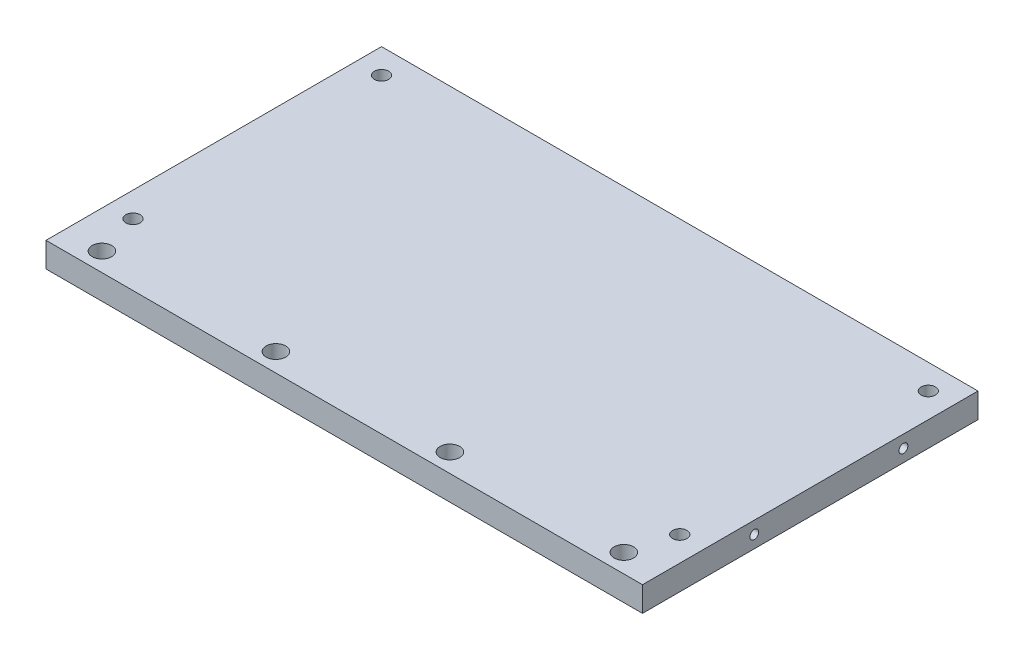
ISO-10303-21;
HEADER;
FILE_DESCRIPTION(('STEP AP214'),'2;1');
FILE_NAME('part.step','',(''),(''),'','','');
FILE_SCHEMA(('AUTOMOTIVE_DESIGN { 1 0 10303 214 1 1 1 1 }'));
ENDSEC;
DATA;
#1=APPLICATION_CONTEXT('core data for automotive mechanical design processes');
#2=APPLICATION_PROTOCOL_DEFINITION('international standard','automotive_design',2000,#1);
#3=PRODUCT_CONTEXT('',#1,'mechanical');
#4=PRODUCT('Part','Part','',(#3));
#5=PRODUCT_RELATED_PRODUCT_CATEGORY('part','',(#4));
#6=PRODUCT_DEFINITION_FORMATION('','',#4);
#7=PRODUCT_DEFINITION_CONTEXT('part definition',#1,'design');
#8=PRODUCT_DEFINITION('design','',#6,#7);
#9=PRODUCT_DEFINITION_SHAPE('','',#8);
#10=(LENGTH_UNIT() NAMED_UNIT(*) SI_UNIT(.MILLI.,.METRE.));
#11=(NAMED_UNIT(*) PLANE_ANGLE_UNIT() SI_UNIT($,.RADIAN.));
#12=(NAMED_UNIT(*) SI_UNIT($,.STERADIAN.) SOLID_ANGLE_UNIT());
#13=UNCERTAINTY_MEASURE_WITH_UNIT(LENGTH_MEASURE(1.E-05),#10,'distance_accuracy_value','');
#14=(GEOMETRIC_REPRESENTATION_CONTEXT(3) GLOBAL_UNCERTAINTY_ASSIGNED_CONTEXT((#13)) GLOBAL_UNIT_ASSIGNED_CONTEXT((#10,
#11,#12)) REPRESENTATION_CONTEXT('',''));
#15=CARTESIAN_POINT('',(0.,0.,0.));
#16=DIRECTION('',(0.,0.,1.));
#17=DIRECTION('',(1.,0.,0.));
#18=AXIS2_PLACEMENT_3D('',#15,#16,#17);
#19=CARTESIAN_POINT('',(0.,6.35,0.));
#20=DIRECTION('',(1.,0.,0.));
#21=DIRECTION('',(0.,0.,-1.));
#22=AXIS2_PLACEMENT_3D('',#19,#20,#21);
#23=PLANE('',#22);
#24=CARTESIAN_POINT('',(0.,3.175,-28.575));
#25=DIRECTION('',(-1.,0.,0.));
#26=DIRECTION('',(0.,0.,1.));
#27=AXIS2_PLACEMENT_3D('',#24,#25,#26);
#28=CIRCLE('',#27,1.1303);
#29=CARTESIAN_POINT('',(0.,3.175,-27.4447));
#30=VERTEX_POINT('',#29);
#31=EDGE_CURVE('E134',#30,#30,#28,.T.);
#32=ORIENTED_EDGE('',*,*,#31,.F.);
#33=EDGE_LOOP('',(#32));
#34=FACE_BOUND('',#33,.T.);
#35=CARTESIAN_POINT('',(0.,3.175,-66.675));
#36=DIRECTION('',(-1.,0.,0.));
#37=DIRECTION('',(0.,0.,1.));
#38=AXIS2_PLACEMENT_3D('',#35,#36,#37);
#39=CIRCLE('',#38,1.1303);
#40=CARTESIAN_POINT('',(0.,3.175,-65.5447));
#41=VERTEX_POINT('',#40);
#42=EDGE_CURVE('E137',#41,#41,#39,.T.);
#43=ORIENTED_EDGE('',*,*,#42,.F.);
#44=EDGE_LOOP('',(#43));
#45=FACE_BOUND('',#44,.T.);
#46=DIRECTION('',(0.,0.,1.));
#47=VECTOR('',#46,1.);
#48=CARTESIAN_POINT('',(0.,0.,0.));
#49=LINE('',#48,#47);
#50=CARTESIAN_POINT('',(0.,0.,-85.725));
#51=VERTEX_POINT('',#50);
#52=CARTESIAN_POINT('',(0.,0.,0.));
#53=VERTEX_POINT('',#52);
#54=EDGE_CURVE('E73',#51,#53,#49,.T.);
#55=ORIENTED_EDGE('',*,*,#54,.T.);
#56=DIRECTION('',(0.,-1.,0.));
#57=VECTOR('',#56,1.);
#58=CARTESIAN_POINT('',(0.,6.35,0.));
#59=LINE('',#58,#57);
#60=CARTESIAN_POINT('',(0.,6.35,0.));
#61=VERTEX_POINT('',#60);
#62=EDGE_CURVE('E11',#61,#53,#59,.T.);
#63=ORIENTED_EDGE('',*,*,#62,.F.);
#64=DIRECTION('',(0.,0.,1.));
#65=VECTOR('',#64,1.);
#66=CARTESIAN_POINT('',(0.,6.35,0.));
#67=LINE('',#66,#65);
#68=CARTESIAN_POINT('',(0.,6.35,-85.725));
#69=VERTEX_POINT('',#68);
#70=EDGE_CURVE('E96',#69,#61,#67,.T.);
#71=ORIENTED_EDGE('',*,*,#70,.F.);
#72=DIRECTION('',(0.,-1.,0.));
#73=VECTOR('',#72,1.);
#74=CARTESIAN_POINT('',(0.,6.35,-85.725));
#75=LINE('',#74,#73);
#76=EDGE_CURVE('E85',#69,#51,#75,.T.);
#77=ORIENTED_EDGE('',*,*,#76,.T.);
#78=EDGE_LOOP('',(#55,#63,#71,#77));
#79=FACE_BOUND('',#78,.T.);
#80=ADVANCED_FACE('F29',(#34,#45,#79),#23,.F.);
#81=CARTESIAN_POINT('',(0.,6.35,0.));
#82=DIRECTION('',(0.,0.,-1.));
#83=DIRECTION('',(-1.,0.,0.));
#84=AXIS2_PLACEMENT_3D('',#81,#82,#83);
#85=PLANE('',#84);
#86=DIRECTION('',(1.,0.,0.));
#87=VECTOR('',#86,1.);
#88=CARTESIAN_POINT('',(0.,0.,0.));
#89=LINE('',#88,#87);
#90=CARTESIAN_POINT('',(152.4,0.,0.));
#91=VERTEX_POINT('',#90);
#92=EDGE_CURVE('E69',#53,#91,#89,.T.);
#93=ORIENTED_EDGE('',*,*,#92,.T.);
#94=DIRECTION('',(0.,-1.,0.));
#95=VECTOR('',#94,1.);
#96=CARTESIAN_POINT('',(152.4,6.35,0.));
#97=LINE('',#96,#95);
#98=CARTESIAN_POINT('',(152.4,6.35,0.));
#99=VERTEX_POINT('',#98);
#100=EDGE_CURVE('E36',#99,#91,#97,.T.);
#101=ORIENTED_EDGE('',*,*,#100,.F.);
#102=DIRECTION('',(1.,0.,0.));
#103=VECTOR('',#102,1.);
#104=CARTESIAN_POINT('',(0.,6.35,0.));
#105=LINE('',#104,#103);
#106=EDGE_CURVE('E81',#61,#99,#105,.T.);
#107=ORIENTED_EDGE('',*,*,#106,.F.);
#108=ORIENTED_EDGE('',*,*,#62,.T.);
#109=EDGE_LOOP('',(#93,#101,#107,#108));
#110=FACE_BOUND('',#109,.T.);
#111=ADVANCED_FACE('F80',(#110),#85,.F.);
#112=CARTESIAN_POINT('',(152.4,6.35,0.));
#113=DIRECTION('',(-1.,0.,0.));
#114=DIRECTION('',(0.,0.,1.));
#115=AXIS2_PLACEMENT_3D('',#112,#113,#114);
#116=PLANE('',#115);
#117=CARTESIAN_POINT('',(152.4,3.175,-66.675));
#118=DIRECTION('',(1.,0.,0.));
#119=DIRECTION('',(0.,0.,-1.));
#120=AXIS2_PLACEMENT_3D('',#117,#118,#119);
#121=CIRCLE('',#120,1.1303);
#122=CARTESIAN_POINT('',(152.4,3.175,-67.8053));
#123=VERTEX_POINT('',#122);
#124=EDGE_CURVE('E172',#123,#123,#121,.T.);
#125=ORIENTED_EDGE('',*,*,#124,.F.);
#126=EDGE_LOOP('',(#125));
#127=FACE_BOUND('',#126,.T.);
#128=CARTESIAN_POINT('',(152.4,3.175,-28.575));
#129=DIRECTION('',(1.,0.,0.));
#130=DIRECTION('',(0.,0.,-1.));
#131=AXIS2_PLACEMENT_3D('',#128,#129,#130);
#132=CIRCLE('',#131,1.1303);
#133=CARTESIAN_POINT('',(152.4,3.175,-29.7053));
#134=VERTEX_POINT('',#133);
#135=EDGE_CURVE('E178',#134,#134,#132,.T.);
#136=ORIENTED_EDGE('',*,*,#135,.F.);
#137=EDGE_LOOP('',(#136));
#138=FACE_BOUND('',#137,.T.);
#139=DIRECTION('',(0.,0.,-1.));
#140=VECTOR('',#139,1.);
#141=CARTESIAN_POINT('',(152.4,0.,0.));
#142=LINE('',#141,#140);
#143=CARTESIAN_POINT('',(152.4,0.,-85.725));
#144=VERTEX_POINT('',#143);
#145=EDGE_CURVE('E74',#91,#144,#142,.T.);
#146=ORIENTED_EDGE('',*,*,#145,.T.);
#147=DIRECTION('',(0.,-1.,0.));
#148=VECTOR('',#147,1.);
#149=CARTESIAN_POINT('',(152.4,6.35,-85.725));
#150=LINE('',#149,#148);
#151=CARTESIAN_POINT('',(152.4,6.35,-85.725));
#152=VERTEX_POINT('',#151);
#153=EDGE_CURVE('E102',#152,#144,#150,.T.);
#154=ORIENTED_EDGE('',*,*,#153,.F.);
#155=DIRECTION('',(0.,0.,-1.));
#156=VECTOR('',#155,1.);
#157=CARTESIAN_POINT('',(152.4,6.35,0.));
#158=LINE('',#157,#156);
#159=EDGE_CURVE('E48',#99,#152,#158,.T.);
#160=ORIENTED_EDGE('',*,*,#159,.F.);
#161=ORIENTED_EDGE('',*,*,#100,.T.);
#162=EDGE_LOOP('',(#146,#154,#160,#161));
#163=FACE_BOUND('',#162,.T.);
#164=ADVANCED_FACE('F105',(#127,#138,#163),#116,.F.);
#165=CARTESIAN_POINT('',(0.,6.35,-85.725));
#166=DIRECTION('',(0.,0.,1.));
#167=DIRECTION('',(1.,0.,0.));
#168=AXIS2_PLACEMENT_3D('',#165,#166,#167);
#169=PLANE('',#168);
#170=CARTESIAN_POINT('',(9.52500000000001,3.175,-85.725));
#171=DIRECTION('',(0.,0.,-1.));
#172=DIRECTION('',(-1.,0.,0.));
#173=AXIS2_PLACEMENT_3D('',#170,#171,#172);
#174=CIRCLE('',#173,1.13029999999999);
#175=CARTESIAN_POINT('',(8.39470000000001,3.175,-85.725));
#176=VERTEX_POINT('',#175);
#177=EDGE_CURVE('E143',#176,#176,#174,.T.);
#178=ORIENTED_EDGE('',*,*,#177,.F.);
#179=EDGE_LOOP('',(#178));
#180=FACE_BOUND('',#179,.T.);
#181=CARTESIAN_POINT('',(53.975,3.175,-85.725));
#182=DIRECTION('',(0.,0.,-1.));
#183=DIRECTION('',(-1.,0.,0.));
#184=AXIS2_PLACEMENT_3D('',#181,#182,#183);
#185=CIRCLE('',#184,1.13029999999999);
#186=CARTESIAN_POINT('',(52.8447,3.175,-85.725));
#187=VERTEX_POINT('',#186);
#188=EDGE_CURVE('E154',#187,#187,#185,.T.);
#189=ORIENTED_EDGE('',*,*,#188,.F.);
#190=EDGE_LOOP('',(#189));
#191=FACE_BOUND('',#190,.T.);
#192=CARTESIAN_POINT('',(98.425,3.175,-85.725));
#193=DIRECTION('',(0.,0.,-1.));
#194=DIRECTION('',(-1.,0.,0.));
#195=AXIS2_PLACEMENT_3D('',#192,#193,#194);
#196=CIRCLE('',#195,1.13029999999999);
#197=CARTESIAN_POINT('',(97.2947,3.175,-85.725));
#198=VERTEX_POINT('',#197);
#199=EDGE_CURVE('E160',#198,#198,#196,.T.);
#200=ORIENTED_EDGE('',*,*,#199,.F.);
#201=EDGE_LOOP('',(#200));
#202=FACE_BOUND('',#201,.T.);
#203=CARTESIAN_POINT('',(142.875,3.175,-85.725));
#204=DIRECTION('',(0.,0.,-1.));
#205=DIRECTION('',(-1.,0.,0.));
#206=AXIS2_PLACEMENT_3D('',#203,#204,#205);
#207=CIRCLE('',#206,1.13029999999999);
#208=CARTESIAN_POINT('',(141.7447,3.175,-85.725));
#209=VERTEX_POINT('',#208);
#210=EDGE_CURVE('E166',#209,#209,#207,.T.);
#211=ORIENTED_EDGE('',*,*,#210,.F.);
#212=EDGE_LOOP('',(#211));
#213=FACE_BOUND('',#212,.T.);
#214=DIRECTION('',(-1.,0.,0.));
#215=VECTOR('',#214,1.);
#216=CARTESIAN_POINT('',(0.,0.,-85.725));
#217=LINE('',#216,#215);
#218=EDGE_CURVE('E94',#144,#51,#217,.T.);
#219=ORIENTED_EDGE('',*,*,#218,.T.);
#220=ORIENTED_EDGE('',*,*,#76,.F.);
#221=DIRECTION('',(-1.,0.,0.));
#222=VECTOR('',#221,1.);
#223=CARTESIAN_POINT('',(0.,6.35,-85.725));
#224=LINE('',#223,#222);
#225=EDGE_CURVE('E43',#152,#69,#224,.T.);
#226=ORIENTED_EDGE('',*,*,#225,.F.);
#227=ORIENTED_EDGE('',*,*,#153,.T.);
#228=EDGE_LOOP('',(#219,#220,#226,#227));
#229=FACE_BOUND('',#228,.T.);
#230=ADVANCED_FACE('F107',(#180,#191,#202,#213,#229),#169,.F.);
#231=CARTESIAN_POINT('',(0.,6.35,-85.725));
#232=DIRECTION('',(0.,-1.,0.));
#233=DIRECTION('',(0.,0.,-1.));
#234=AXIS2_PLACEMENT_3D('',#231,#232,#233);
#235=PLANE('',#234);
#236=CARTESIAN_POINT('',(142.875,6.35,-4.76250000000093));
#237=DIRECTION('',(0.,1.,0.));
#238=DIRECTION('',(0.,0.,1.));
#239=AXIS2_PLACEMENT_3D('',#236,#237,#238);
#240=CIRCLE('',#239,2.4892);
#241=CARTESIAN_POINT('',(142.875,6.35,-2.27330000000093));
#242=VERTEX_POINT('',#241);
#243=EDGE_CURVE('E184',#242,#242,#240,.T.);
#244=ORIENTED_EDGE('',*,*,#243,.F.);
#245=EDGE_LOOP('',(#244));
#246=FACE_BOUND('',#245,.T.);
#247=CARTESIAN_POINT('',(98.425,6.35,-4.76250000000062));
#248=DIRECTION('',(0.,1.,0.));
#249=DIRECTION('',(0.,0.,1.));
#250=AXIS2_PLACEMENT_3D('',#247,#248,#249);
#251=CIRCLE('',#250,2.4892);
#252=CARTESIAN_POINT('',(98.425,6.35,-2.27330000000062));
#253=VERTEX_POINT('',#252);
#254=EDGE_CURVE('E190',#253,#253,#251,.T.);
#255=ORIENTED_EDGE('',*,*,#254,.F.);
#256=EDGE_LOOP('',(#255));
#257=FACE_BOUND('',#256,.T.);
#258=CARTESIAN_POINT('',(53.975,6.35,-4.76250000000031));
#259=DIRECTION('',(0.,1.,0.));
#260=DIRECTION('',(0.,0.,1.));
#261=AXIS2_PLACEMENT_3D('',#258,#259,#260);
#262=CIRCLE('',#261,2.4892);
#263=CARTESIAN_POINT('',(53.975,6.35,-2.27330000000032));
#264=VERTEX_POINT('',#263);
#265=EDGE_CURVE('E196',#264,#264,#262,.T.);
#266=ORIENTED_EDGE('',*,*,#265,.F.);
#267=EDGE_LOOP('',(#266));
#268=FACE_BOUND('',#267,.T.);
#269=CARTESIAN_POINT('',(9.525,6.35,-4.7625));
#270=DIRECTION('',(0.,1.,0.));
#271=DIRECTION('',(0.,0.,1.));
#272=AXIS2_PLACEMENT_3D('',#269,#270,#271);
#273=CIRCLE('',#272,2.4892);
#274=CARTESIAN_POINT('',(9.525,6.35,-2.2733));
#275=VERTEX_POINT('',#274);
#276=EDGE_CURVE('E202',#275,#275,#273,.T.);
#277=ORIENTED_EDGE('',*,*,#276,.F.);
#278=EDGE_LOOP('',(#277));
#279=FACE_BOUND('',#278,.T.);
#280=CARTESIAN_POINT('',(146.05,6.35,-15.875000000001));
#281=DIRECTION('',(0.,1.,0.));
#282=DIRECTION('',(0.,0.,1.));
#283=AXIS2_PLACEMENT_3D('',#280,#281,#282);
#284=CIRCLE('',#283,1.82879999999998);
#285=CARTESIAN_POINT('',(146.05,6.35,-14.046200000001));
#286=VERTEX_POINT('',#285);
#287=EDGE_CURVE('E208',#286,#286,#284,.T.);
#288=ORIENTED_EDGE('',*,*,#287,.F.);
#289=EDGE_LOOP('',(#288));
#290=FACE_BOUND('',#289,.T.);
#291=CARTESIAN_POINT('',(6.35000000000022,6.35,-15.875));
#292=DIRECTION('',(0.,1.,0.));
#293=DIRECTION('',(0.,0.,1.));
#294=AXIS2_PLACEMENT_3D('',#291,#292,#293);
#295=CIRCLE('',#294,1.8288);
#296=CARTESIAN_POINT('',(6.35000000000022,6.35,-14.0462));
#297=VERTEX_POINT('',#296);
#298=EDGE_CURVE('E214',#297,#297,#295,.T.);
#299=ORIENTED_EDGE('',*,*,#298,.F.);
#300=EDGE_LOOP('',(#299));
#301=FACE_BOUND('',#300,.T.);
#302=CARTESIAN_POINT('',(146.05,6.35,-79.375000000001));
#303=DIRECTION('',(0.,1.,0.));
#304=DIRECTION('',(0.,0.,1.));
#305=AXIS2_PLACEMENT_3D('',#302,#303,#304);
#306=CIRCLE('',#305,1.82879999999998);
#307=CARTESIAN_POINT('',(146.05,6.35,-77.546200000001));
#308=VERTEX_POINT('',#307);
#309=EDGE_CURVE('E220',#308,#308,#306,.T.);
#310=ORIENTED_EDGE('',*,*,#309,.F.);
#311=EDGE_LOOP('',(#310));
#312=FACE_BOUND('',#311,.T.);
#313=CARTESIAN_POINT('',(6.35,6.35,-79.375));
#314=DIRECTION('',(0.,1.,0.));
#315=DIRECTION('',(0.,0.,1.));
#316=AXIS2_PLACEMENT_3D('',#313,#314,#315);
#317=CIRCLE('',#316,1.8288);
#318=CARTESIAN_POINT('',(6.35,6.35,-77.5462));
#319=VERTEX_POINT('',#318);
#320=EDGE_CURVE('E89',#319,#319,#317,.T.);
#321=ORIENTED_EDGE('',*,*,#320,.F.);
#322=EDGE_LOOP('',(#321));
#323=FACE_BOUND('',#322,.T.);
#324=ORIENTED_EDGE('',*,*,#70,.T.);
#325=ORIENTED_EDGE('',*,*,#106,.T.);
#326=ORIENTED_EDGE('',*,*,#159,.T.);
#327=ORIENTED_EDGE('',*,*,#225,.T.);
#328=EDGE_LOOP('',(#324,#325,#326,#327));
#329=FACE_BOUND('',#328,.T.);
#330=ADVANCED_FACE('F108',(#246,#257,#268,#279,#290,#301,#312,#323,#329),#235,.F.);
#331=CARTESIAN_POINT('',(0.,0.,-85.725));
#332=DIRECTION('',(0.,-1.,0.));
#333=DIRECTION('',(0.,0.,-1.));
#334=AXIS2_PLACEMENT_3D('',#331,#332,#333);
#335=PLANE('',#334);
#336=CARTESIAN_POINT('',(142.875,0.,-4.76250000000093));
#337=DIRECTION('',(0.,1.,0.));
#338=DIRECTION('',(0.,0.,1.));
#339=AXIS2_PLACEMENT_3D('',#336,#337,#338);
#340=CIRCLE('',#339,2.4892);
#341=CARTESIAN_POINT('',(142.875,0.,-2.27330000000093));
#342=VERTEX_POINT('',#341);
#343=EDGE_CURVE('E187',#342,#342,#340,.T.);
#344=ORIENTED_EDGE('',*,*,#343,.T.);
#345=EDGE_LOOP('',(#344));
#346=FACE_BOUND('',#345,.T.);
#347=CARTESIAN_POINT('',(98.425,0.,-4.76250000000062));
#348=DIRECTION('',(0.,1.,0.));
#349=DIRECTION('',(0.,0.,1.));
#350=AXIS2_PLACEMENT_3D('',#347,#348,#349);
#351=CIRCLE('',#350,2.4892);
#352=CARTESIAN_POINT('',(98.425,0.,-2.27330000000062));
#353=VERTEX_POINT('',#352);
#354=EDGE_CURVE('E193',#353,#353,#351,.T.);
#355=ORIENTED_EDGE('',*,*,#354,.T.);
#356=EDGE_LOOP('',(#355));
#357=FACE_BOUND('',#356,.T.);
#358=CARTESIAN_POINT('',(53.975,0.,-4.76250000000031));
#359=DIRECTION('',(0.,1.,0.));
#360=DIRECTION('',(0.,0.,1.));
#361=AXIS2_PLACEMENT_3D('',#358,#359,#360);
#362=CIRCLE('',#361,2.4892);
#363=CARTESIAN_POINT('',(53.975,0.,-2.27330000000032));
#364=VERTEX_POINT('',#363);
#365=EDGE_CURVE('E199',#364,#364,#362,.T.);
#366=ORIENTED_EDGE('',*,*,#365,.T.);
#367=EDGE_LOOP('',(#366));
#368=FACE_BOUND('',#367,.T.);
#369=CARTESIAN_POINT('',(9.525,0.,-4.7625));
#370=DIRECTION('',(0.,1.,0.));
#371=DIRECTION('',(0.,0.,1.));
#372=AXIS2_PLACEMENT_3D('',#369,#370,#371);
#373=CIRCLE('',#372,2.4892);
#374=CARTESIAN_POINT('',(9.525,0.,-2.2733));
#375=VERTEX_POINT('',#374);
#376=EDGE_CURVE('E205',#375,#375,#373,.T.);
#377=ORIENTED_EDGE('',*,*,#376,.T.);
#378=EDGE_LOOP('',(#377));
#379=FACE_BOUND('',#378,.T.);
#380=CARTESIAN_POINT('',(146.05,0.,-15.875000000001));
#381=DIRECTION('',(0.,1.,0.));
#382=DIRECTION('',(0.,0.,1.));
#383=AXIS2_PLACEMENT_3D('',#380,#381,#382);
#384=CIRCLE('',#383,1.82879999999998);
#385=CARTESIAN_POINT('',(146.05,0.,-14.046200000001));
#386=VERTEX_POINT('',#385);
#387=EDGE_CURVE('E211',#386,#386,#384,.T.);
#388=ORIENTED_EDGE('',*,*,#387,.T.);
#389=EDGE_LOOP('',(#388));
#390=FACE_BOUND('',#389,.T.);
#391=CARTESIAN_POINT('',(6.35000000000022,0.,-15.875));
#392=DIRECTION('',(0.,1.,0.));
#393=DIRECTION('',(0.,0.,1.));
#394=AXIS2_PLACEMENT_3D('',#391,#392,#393);
#395=CIRCLE('',#394,1.8288);
#396=CARTESIAN_POINT('',(6.35000000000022,0.,-14.0462));
#397=VERTEX_POINT('',#396);
#398=EDGE_CURVE('E217',#397,#397,#395,.T.);
#399=ORIENTED_EDGE('',*,*,#398,.T.);
#400=EDGE_LOOP('',(#399));
#401=FACE_BOUND('',#400,.T.);
#402=CARTESIAN_POINT('',(146.05,0.,-79.375000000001));
#403=DIRECTION('',(0.,1.,0.));
#404=DIRECTION('',(0.,0.,1.));
#405=AXIS2_PLACEMENT_3D('',#402,#403,#404);
#406=CIRCLE('',#405,1.82879999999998);
#407=CARTESIAN_POINT('',(146.05,0.,-77.546200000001));
#408=VERTEX_POINT('',#407);
#409=EDGE_CURVE('E223',#408,#408,#406,.T.);
#410=ORIENTED_EDGE('',*,*,#409,.T.);
#411=EDGE_LOOP('',(#410));
#412=FACE_BOUND('',#411,.T.);
#413=CARTESIAN_POINT('',(6.35,0.,-79.375));
#414=DIRECTION('',(0.,1.,0.));
#415=DIRECTION('',(0.,0.,1.));
#416=AXIS2_PLACEMENT_3D('',#413,#414,#415);
#417=CIRCLE('',#416,1.8288);
#418=CARTESIAN_POINT('',(6.35,0.,-77.5462));
#419=VERTEX_POINT('',#418);
#420=EDGE_CURVE('E86',#419,#419,#417,.T.);
#421=ORIENTED_EDGE('',*,*,#420,.T.);
#422=EDGE_LOOP('',(#421));
#423=FACE_BOUND('',#422,.T.);
#424=ORIENTED_EDGE('',*,*,#54,.F.);
#425=ORIENTED_EDGE('',*,*,#218,.F.);
#426=ORIENTED_EDGE('',*,*,#145,.F.);
#427=ORIENTED_EDGE('',*,*,#92,.F.);
#428=EDGE_LOOP('',(#424,#425,#426,#427));
#429=FACE_BOUND('',#428,.T.);
#430=ADVANCED_FACE('F70',(#346,#357,#368,#379,#390,#401,#412,#423,#429),#335,.T.);
#431=CARTESIAN_POINT('',(6.35,0.,-79.375));
#432=DIRECTION('',(0.,1.,0.));
#433=DIRECTION('',(0.,0.,1.));
#434=AXIS2_PLACEMENT_3D('',#431,#432,#433);
#435=CYLINDRICAL_SURFACE('',#434,1.8288);
#436=ORIENTED_EDGE('',*,*,#420,.F.);
#437=EDGE_LOOP('',(#436));
#438=FACE_BOUND('',#437,.T.);
#439=ORIENTED_EDGE('',*,*,#320,.T.);
#440=EDGE_LOOP('',(#439));
#441=FACE_BOUND('',#440,.T.);
#442=ADVANCED_FACE('F116',(#438,#441),#435,.F.);
#443=CARTESIAN_POINT('',(146.05,0.,-79.375000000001));
#444=DIRECTION('',(0.,1.,0.));
#445=DIRECTION('',(0.,0.,1.));
#446=AXIS2_PLACEMENT_3D('',#443,#444,#445);
#447=CYLINDRICAL_SURFACE('',#446,1.82879999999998);
#448=ORIENTED_EDGE('',*,*,#409,.F.);
#449=EDGE_LOOP('',(#448));
#450=FACE_BOUND('',#449,.T.);
#451=ORIENTED_EDGE('',*,*,#309,.T.);
#452=EDGE_LOOP('',(#451));
#453=FACE_BOUND('',#452,.T.);
#454=ADVANCED_FACE('F230',(#450,#453),#447,.F.);
#455=CARTESIAN_POINT('',(6.35000000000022,0.,-15.875));
#456=DIRECTION('',(0.,1.,0.));
#457=DIRECTION('',(0.,0.,1.));
#458=AXIS2_PLACEMENT_3D('',#455,#456,#457);
#459=CYLINDRICAL_SURFACE('',#458,1.8288);
#460=ORIENTED_EDGE('',*,*,#398,.F.);
#461=EDGE_LOOP('',(#460));
#462=FACE_BOUND('',#461,.T.);
#463=ORIENTED_EDGE('',*,*,#298,.T.);
#464=EDGE_LOOP('',(#463));
#465=FACE_BOUND('',#464,.T.);
#466=ADVANCED_FACE('F236',(#462,#465),#459,.F.);
#467=CARTESIAN_POINT('',(146.05,0.,-15.875000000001));
#468=DIRECTION('',(0.,1.,0.));
#469=DIRECTION('',(0.,0.,1.));
#470=AXIS2_PLACEMENT_3D('',#467,#468,#469);
#471=CYLINDRICAL_SURFACE('',#470,1.82879999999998);
#472=ORIENTED_EDGE('',*,*,#387,.F.);
#473=EDGE_LOOP('',(#472));
#474=FACE_BOUND('',#473,.T.);
#475=ORIENTED_EDGE('',*,*,#287,.T.);
#476=EDGE_LOOP('',(#475));
#477=FACE_BOUND('',#476,.T.);
#478=ADVANCED_FACE('F243',(#474,#477),#471,.F.);
#479=CARTESIAN_POINT('',(9.525,0.,-4.7625));
#480=DIRECTION('',(0.,1.,0.));
#481=DIRECTION('',(0.,0.,1.));
#482=AXIS2_PLACEMENT_3D('',#479,#480,#481);
#483=CYLINDRICAL_SURFACE('',#482,2.4892);
#484=ORIENTED_EDGE('',*,*,#376,.F.);
#485=EDGE_LOOP('',(#484));
#486=FACE_BOUND('',#485,.T.);
#487=ORIENTED_EDGE('',*,*,#276,.T.);
#488=EDGE_LOOP('',(#487));
#489=FACE_BOUND('',#488,.T.);
#490=ADVANCED_FACE('F246',(#486,#489),#483,.F.);
#491=CARTESIAN_POINT('',(53.975,0.,-4.76250000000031));
#492=DIRECTION('',(0.,1.,0.));
#493=DIRECTION('',(0.,0.,1.));
#494=AXIS2_PLACEMENT_3D('',#491,#492,#493);
#495=CYLINDRICAL_SURFACE('',#494,2.4892);
#496=ORIENTED_EDGE('',*,*,#365,.F.);
#497=EDGE_LOOP('',(#496));
#498=FACE_BOUND('',#497,.T.);
#499=ORIENTED_EDGE('',*,*,#265,.T.);
#500=EDGE_LOOP('',(#499));
#501=FACE_BOUND('',#500,.T.);
#502=ADVANCED_FACE('F250',(#498,#501),#495,.F.);
#503=CARTESIAN_POINT('',(98.425,0.,-4.76250000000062));
#504=DIRECTION('',(0.,1.,0.));
#505=DIRECTION('',(0.,0.,1.));
#506=AXIS2_PLACEMENT_3D('',#503,#504,#505);
#507=CYLINDRICAL_SURFACE('',#506,2.4892);
#508=ORIENTED_EDGE('',*,*,#354,.F.);
#509=EDGE_LOOP('',(#508));
#510=FACE_BOUND('',#509,.T.);
#511=ORIENTED_EDGE('',*,*,#254,.T.);
#512=EDGE_LOOP('',(#511));
#513=FACE_BOUND('',#512,.T.);
#514=ADVANCED_FACE('F254',(#510,#513),#507,.F.);
#515=CARTESIAN_POINT('',(142.875,0.,-4.76250000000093));
#516=DIRECTION('',(0.,1.,0.));
#517=DIRECTION('',(0.,0.,1.));
#518=AXIS2_PLACEMENT_3D('',#515,#516,#517);
#519=CYLINDRICAL_SURFACE('',#518,2.4892);
#520=ORIENTED_EDGE('',*,*,#343,.F.);
#521=EDGE_LOOP('',(#520));
#522=FACE_BOUND('',#521,.T.);
#523=ORIENTED_EDGE('',*,*,#243,.T.);
#524=EDGE_LOOP('',(#523));
#525=FACE_BOUND('',#524,.T.);
#526=ADVANCED_FACE('F258',(#522,#525),#519,.F.);
#527=CARTESIAN_POINT('',(139.7,3.175,-28.575));
#528=DIRECTION('',(1.,0.,0.));
#529=DIRECTION('',(0.,0.,-1.));
#530=AXIS2_PLACEMENT_3D('',#527,#528,#529);
#531=CYLINDRICAL_SURFACE('',#530,1.1303);
#532=CARTESIAN_POINT('',(139.7,3.175,-28.575));
#533=DIRECTION('',(1.,0.,0.));
#534=DIRECTION('',(0.,0.,-1.));
#535=AXIS2_PLACEMENT_3D('',#532,#533,#534);
#536=CIRCLE('',#535,1.1303);
#537=CARTESIAN_POINT('',(139.7,3.175,-29.7053));
#538=VERTEX_POINT('',#537);
#539=EDGE_CURVE('E181',#538,#538,#536,.T.);
#540=ORIENTED_EDGE('',*,*,#539,.F.);
#541=EDGE_LOOP('',(#540));
#542=FACE_BOUND('',#541,.T.);
#543=ORIENTED_EDGE('',*,*,#135,.T.);
#544=EDGE_LOOP('',(#543));
#545=FACE_BOUND('',#544,.T.);
#546=ADVANCED_FACE('F262',(#542,#545),#531,.F.);
#547=CARTESIAN_POINT('',(139.7,3.175,-28.575));
#548=DIRECTION('',(1.,0.,0.));
#549=DIRECTION('',(0.,0.,-1.));
#550=AXIS2_PLACEMENT_3D('',#547,#548,#549);
#551=PLANE('',#550);
#552=ORIENTED_EDGE('',*,*,#539,.T.);
#553=EDGE_LOOP('',(#552));
#554=FACE_BOUND('',#553,.T.);
#555=ADVANCED_FACE('F266',(#554),#551,.T.);
#556=CARTESIAN_POINT('',(139.7,3.175,-66.675));
#557=DIRECTION('',(1.,0.,0.));
#558=DIRECTION('',(0.,0.,-1.));
#559=AXIS2_PLACEMENT_3D('',#556,#557,#558);
#560=CYLINDRICAL_SURFACE('',#559,1.1303);
#561=CARTESIAN_POINT('',(139.7,3.175,-66.675));
#562=DIRECTION('',(1.,0.,0.));
#563=DIRECTION('',(0.,0.,-1.));
#564=AXIS2_PLACEMENT_3D('',#561,#562,#563);
#565=CIRCLE('',#564,1.1303);
#566=CARTESIAN_POINT('',(139.7,3.175,-67.8053));
#567=VERTEX_POINT('',#566);
#568=EDGE_CURVE('E175',#567,#567,#565,.T.);
#569=ORIENTED_EDGE('',*,*,#568,.F.);
#570=EDGE_LOOP('',(#569));
#571=FACE_BOUND('',#570,.T.);
#572=ORIENTED_EDGE('',*,*,#124,.T.);
#573=EDGE_LOOP('',(#572));
#574=FACE_BOUND('',#573,.T.);
#575=ADVANCED_FACE('F270',(#571,#574),#560,.F.);
#576=CARTESIAN_POINT('',(139.7,3.175,-66.675));
#577=DIRECTION('',(1.,0.,0.));
#578=DIRECTION('',(0.,0.,-1.));
#579=AXIS2_PLACEMENT_3D('',#576,#577,#578);
#580=PLANE('',#579);
#581=ORIENTED_EDGE('',*,*,#568,.T.);
#582=EDGE_LOOP('',(#581));
#583=FACE_BOUND('',#582,.T.);
#584=ADVANCED_FACE('F274',(#583),#580,.T.);
#585=CARTESIAN_POINT('',(142.875,3.175,-73.025));
#586=DIRECTION('',(0.,0.,-1.));
#587=DIRECTION('',(-1.,0.,0.));
#588=AXIS2_PLACEMENT_3D('',#585,#586,#587);
#589=CYLINDRICAL_SURFACE('',#588,1.13029999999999);
#590=CARTESIAN_POINT('',(142.875,3.175,-73.025));
#591=DIRECTION('',(0.,0.,-1.));
#592=DIRECTION('',(-1.,0.,0.));
#593=AXIS2_PLACEMENT_3D('',#590,#591,#592);
#594=CIRCLE('',#593,1.13029999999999);
#595=CARTESIAN_POINT('',(141.7447,3.175,-73.025));
#596=VERTEX_POINT('',#595);
#597=EDGE_CURVE('E169',#596,#596,#594,.T.);
#598=ORIENTED_EDGE('',*,*,#597,.F.);
#599=EDGE_LOOP('',(#598));
#600=FACE_BOUND('',#599,.T.);
#601=ORIENTED_EDGE('',*,*,#210,.T.);
#602=EDGE_LOOP('',(#601));
#603=FACE_BOUND('',#602,.T.);
#604=ADVANCED_FACE('F278',(#600,#603),#589,.F.);
#605=CARTESIAN_POINT('',(142.875,3.175,-73.025));
#606=DIRECTION('',(0.,0.,-1.));
#607=DIRECTION('',(-1.,0.,0.));
#608=AXIS2_PLACEMENT_3D('',#605,#606,#607);
#609=PLANE('',#608);
#610=ORIENTED_EDGE('',*,*,#597,.T.);
#611=EDGE_LOOP('',(#610));
#612=FACE_BOUND('',#611,.T.);
#613=ADVANCED_FACE('F282',(#612),#609,.T.);
#614=CARTESIAN_POINT('',(98.425,3.175,-73.025));
#615=DIRECTION('',(0.,0.,-1.));
#616=DIRECTION('',(-1.,0.,0.));
#617=AXIS2_PLACEMENT_3D('',#614,#615,#616);
#618=CYLINDRICAL_SURFACE('',#617,1.13029999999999);
#619=CARTESIAN_POINT('',(98.425,3.175,-73.025));
#620=DIRECTION('',(0.,0.,-1.));
#621=DIRECTION('',(-1.,0.,0.));
#622=AXIS2_PLACEMENT_3D('',#619,#620,#621);
#623=CIRCLE('',#622,1.13029999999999);
#624=CARTESIAN_POINT('',(97.2947,3.175,-73.025));
#625=VERTEX_POINT('',#624);
#626=EDGE_CURVE('E163',#625,#625,#623,.T.);
#627=ORIENTED_EDGE('',*,*,#626,.F.);
#628=EDGE_LOOP('',(#627));
#629=FACE_BOUND('',#628,.T.);
#630=ORIENTED_EDGE('',*,*,#199,.T.);
#631=EDGE_LOOP('',(#630));
#632=FACE_BOUND('',#631,.T.);
#633=ADVANCED_FACE('F286',(#629,#632),#618,.F.);
#634=CARTESIAN_POINT('',(98.425,3.175,-73.025));
#635=DIRECTION('',(0.,0.,-1.));
#636=DIRECTION('',(-1.,0.,0.));
#637=AXIS2_PLACEMENT_3D('',#634,#635,#636);
#638=PLANE('',#637);
#639=ORIENTED_EDGE('',*,*,#626,.T.);
#640=EDGE_LOOP('',(#639));
#641=FACE_BOUND('',#640,.T.);
#642=ADVANCED_FACE('F290',(#641),#638,.T.);
#643=CARTESIAN_POINT('',(53.975,3.175,-73.025));
#644=DIRECTION('',(0.,0.,-1.));
#645=DIRECTION('',(-1.,0.,0.));
#646=AXIS2_PLACEMENT_3D('',#643,#644,#645);
#647=CYLINDRICAL_SURFACE('',#646,1.13029999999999);
#648=CARTESIAN_POINT('',(53.975,3.175,-73.025));
#649=DIRECTION('',(0.,0.,-1.));
#650=DIRECTION('',(-1.,0.,0.));
#651=AXIS2_PLACEMENT_3D('',#648,#649,#650);
#652=CIRCLE('',#651,1.13029999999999);
#653=CARTESIAN_POINT('',(52.8447,3.175,-73.025));
#654=VERTEX_POINT('',#653);
#655=EDGE_CURVE('E157',#654,#654,#652,.T.);
#656=ORIENTED_EDGE('',*,*,#655,.F.);
#657=EDGE_LOOP('',(#656));
#658=FACE_BOUND('',#657,.T.);
#659=ORIENTED_EDGE('',*,*,#188,.T.);
#660=EDGE_LOOP('',(#659));
#661=FACE_BOUND('',#660,.T.);
#662=ADVANCED_FACE('F294',(#658,#661),#647,.F.);
#663=CARTESIAN_POINT('',(53.975,3.175,-73.025));
#664=DIRECTION('',(0.,0.,-1.));
#665=DIRECTION('',(-1.,0.,0.));
#666=AXIS2_PLACEMENT_3D('',#663,#664,#665);
#667=PLANE('',#666);
#668=ORIENTED_EDGE('',*,*,#655,.T.);
#669=EDGE_LOOP('',(#668));
#670=FACE_BOUND('',#669,.T.);
#671=ADVANCED_FACE('F298',(#670),#667,.T.);
#672=CARTESIAN_POINT('',(9.52500000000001,3.175,-73.025));
#673=DIRECTION('',(0.,0.,-1.));
#674=DIRECTION('',(-1.,0.,0.));
#675=AXIS2_PLACEMENT_3D('',#672,#673,#674);
#676=CYLINDRICAL_SURFACE('',#675,1.13029999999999);
#677=CARTESIAN_POINT('',(9.52500000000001,3.175,-73.025));
#678=DIRECTION('',(0.,0.,-1.));
#679=DIRECTION('',(-1.,0.,0.));
#680=AXIS2_PLACEMENT_3D('',#677,#678,#679);
#681=CIRCLE('',#680,1.13029999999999);
#682=CARTESIAN_POINT('',(8.39470000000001,3.175,-73.025));
#683=VERTEX_POINT('',#682);
#684=EDGE_CURVE('E151',#683,#683,#681,.T.);
#685=ORIENTED_EDGE('',*,*,#684,.F.);
#686=EDGE_LOOP('',(#685));
#687=FACE_BOUND('',#686,.T.);
#688=ORIENTED_EDGE('',*,*,#177,.T.);
#689=EDGE_LOOP('',(#688));
#690=FACE_BOUND('',#689,.T.);
#691=ADVANCED_FACE('F302',(#687,#690),#676,.F.);
#692=CARTESIAN_POINT('',(9.52500000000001,3.175,-73.025));
#693=DIRECTION('',(0.,0.,-1.));
#694=DIRECTION('',(-1.,0.,0.));
#695=AXIS2_PLACEMENT_3D('',#692,#693,#694);
#696=PLANE('',#695);
#697=ORIENTED_EDGE('',*,*,#684,.T.);
#698=EDGE_LOOP('',(#697));
#699=FACE_BOUND('',#698,.T.);
#700=ADVANCED_FACE('F306',(#699),#696,.T.);
#701=CARTESIAN_POINT('',(12.7,3.175,-66.675));
#702=DIRECTION('',(-1.,0.,0.));
#703=DIRECTION('',(0.,0.,1.));
#704=AXIS2_PLACEMENT_3D('',#701,#702,#703);
#705=CYLINDRICAL_SURFACE('',#704,1.1303);
#706=CARTESIAN_POINT('',(12.7,3.175,-66.675));
#707=DIRECTION('',(-1.,0.,0.));
#708=DIRECTION('',(0.,0.,1.));
#709=AXIS2_PLACEMENT_3D('',#706,#707,#708);
#710=CIRCLE('',#709,1.1303);
#711=CARTESIAN_POINT('',(12.7,3.175,-65.5447));
#712=VERTEX_POINT('',#711);
#713=EDGE_CURVE('E139',#712,#712,#710,.T.);
#714=ORIENTED_EDGE('',*,*,#713,.F.);
#715=EDGE_LOOP('',(#714));
#716=FACE_BOUND('',#715,.T.);
#717=ORIENTED_EDGE('',*,*,#42,.T.);
#718=EDGE_LOOP('',(#717));
#719=FACE_BOUND('',#718,.T.);
#720=ADVANCED_FACE('F309',(#716,#719),#705,.F.);
#721=CARTESIAN_POINT('',(12.7,3.175,-66.675));
#722=DIRECTION('',(-1.,0.,0.));
#723=DIRECTION('',(0.,0.,1.));
#724=AXIS2_PLACEMENT_3D('',#721,#722,#723);
#725=PLANE('',#724);
#726=ORIENTED_EDGE('',*,*,#713,.T.);
#727=EDGE_LOOP('',(#726));
#728=FACE_BOUND('',#727,.T.);
#729=ADVANCED_FACE('F312',(#728),#725,.T.);
#730=CARTESIAN_POINT('',(12.7,3.175,-28.575));
#731=DIRECTION('',(-1.,0.,0.));
#732=DIRECTION('',(0.,0.,1.));
#733=AXIS2_PLACEMENT_3D('',#730,#731,#732);
#734=CYLINDRICAL_SURFACE('',#733,1.1303);
#735=CARTESIAN_POINT('',(12.7,3.175,-28.575));
#736=DIRECTION('',(-1.,0.,0.));
#737=DIRECTION('',(0.,0.,1.));
#738=AXIS2_PLACEMENT_3D('',#735,#736,#737);
#739=CIRCLE('',#738,1.1303);
#740=CARTESIAN_POINT('',(12.7,3.175,-27.4447));
#741=VERTEX_POINT('',#740);
#742=EDGE_CURVE('E140',#741,#741,#739,.T.);
#743=ORIENTED_EDGE('',*,*,#742,.F.);
#744=EDGE_LOOP('',(#743));
#745=FACE_BOUND('',#744,.T.);
#746=ORIENTED_EDGE('',*,*,#31,.T.);
#747=EDGE_LOOP('',(#746));
#748=FACE_BOUND('',#747,.T.);
#749=ADVANCED_FACE('F316',(#745,#748),#734,.F.);
#750=CARTESIAN_POINT('',(12.7,3.175,-28.575));
#751=DIRECTION('',(-1.,0.,0.));
#752=DIRECTION('',(0.,0.,1.));
#753=AXIS2_PLACEMENT_3D('',#750,#751,#752);
#754=PLANE('',#753);
#755=ORIENTED_EDGE('',*,*,#742,.T.);
#756=EDGE_LOOP('',(#755));
#757=FACE_BOUND('',#756,.T.);
#758=ADVANCED_FACE('F320',(#757),#754,.T.);
#759=CLOSED_SHELL('',(#80,#111,#164,#230,#330,#430,#442,#454,#466,#478,#490,#502,#514,#526,#546,
#555,#575,#584,#604,#613,#633,#642,#662,#671,#691,#700,#720,#729,#749,#758));
#760=MANIFOLD_SOLID_BREP('B2',#759);
#761=ADVANCED_BREP_SHAPE_REPRESENTATION('',(#18,#760),#14);
#762=SHAPE_DEFINITION_REPRESENTATION(#9,#761);
ENDSEC;
END-ISO-10303-21;
